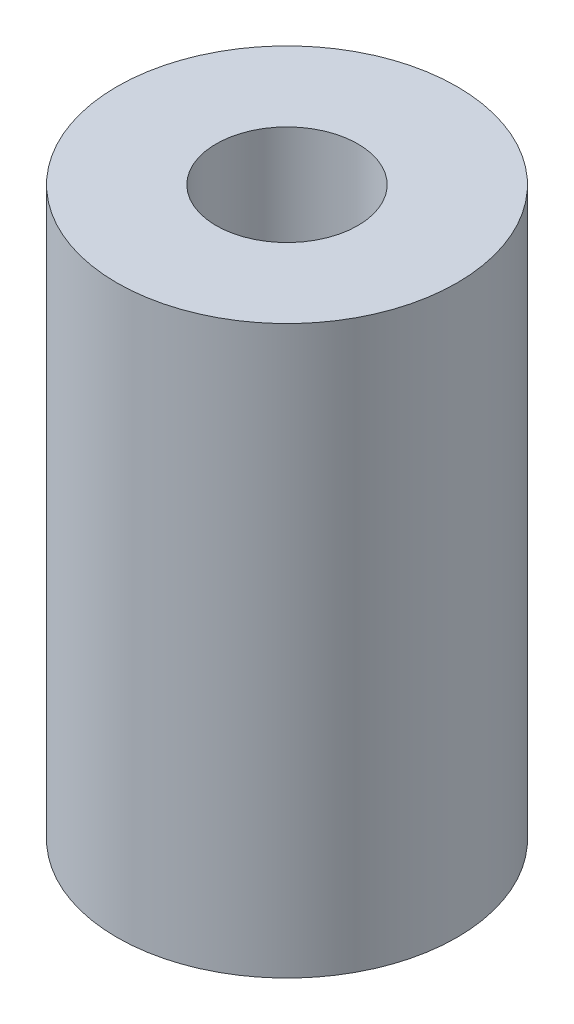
ISO-10303-21;
HEADER;
FILE_DESCRIPTION(('STEP AP214'),'2;1');
FILE_NAME('part.step','',(''),(''),'','','');
FILE_SCHEMA(('AUTOMOTIVE_DESIGN { 1 0 10303 214 1 1 1 1 }'));
ENDSEC;
DATA;
#1=APPLICATION_CONTEXT('core data for automotive mechanical design processes');
#2=APPLICATION_PROTOCOL_DEFINITION('international standard','automotive_design',2000,#1);
#3=PRODUCT_CONTEXT('',#1,'mechanical');
#4=PRODUCT('Part','Part','',(#3));
#5=PRODUCT_RELATED_PRODUCT_CATEGORY('part','',(#4));
#6=PRODUCT_DEFINITION_FORMATION('','',#4);
#7=PRODUCT_DEFINITION_CONTEXT('part definition',#1,'design');
#8=PRODUCT_DEFINITION('design','',#6,#7);
#9=PRODUCT_DEFINITION_SHAPE('','',#8);
#10=(LENGTH_UNIT() NAMED_UNIT(*) SI_UNIT(.MILLI.,.METRE.));
#11=(NAMED_UNIT(*) PLANE_ANGLE_UNIT() SI_UNIT($,.RADIAN.));
#12=(NAMED_UNIT(*) SI_UNIT($,.STERADIAN.) SOLID_ANGLE_UNIT());
#13=UNCERTAINTY_MEASURE_WITH_UNIT(LENGTH_MEASURE(1.E-05),#10,'distance_accuracy_value','');
#14=(GEOMETRIC_REPRESENTATION_CONTEXT(3) GLOBAL_UNCERTAINTY_ASSIGNED_CONTEXT((#13)) GLOBAL_UNIT_ASSIGNED_CONTEXT((#10,
#11,#12)) REPRESENTATION_CONTEXT('',''));
#15=CARTESIAN_POINT('',(0.,0.,0.));
#16=DIRECTION('',(0.,0.,1.));
#17=DIRECTION('',(1.,0.,0.));
#18=AXIS2_PLACEMENT_3D('',#15,#16,#17);
#19=CARTESIAN_POINT('',(7.62,19.05,0.));
#20=DIRECTION('',(0.,1.,0.));
#21=DIRECTION('',(-1.,0.,0.));
#22=AXIS2_PLACEMENT_3D('',#19,#20,#21);
#23=PLANE('',#22);
#24=CARTESIAN_POINT('',(0.,19.05,0.));
#25=DIRECTION('',(0.,-1.,0.));
#26=DIRECTION('',(1.,0.,0.));
#27=AXIS2_PLACEMENT_3D('',#24,#25,#26);
#28=CIRCLE('',#27,3.17500000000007);
#29=CARTESIAN_POINT('',(3.175,19.05,0.));
#30=VERTEX_POINT('',#29);
#31=EDGE_CURVE('E10',#30,#30,#28,.T.);
#32=ORIENTED_EDGE('',*,*,#31,.T.);
#33=EDGE_LOOP('',(#32));
#34=FACE_BOUND('',#33,.T.);
#35=CARTESIAN_POINT('',(0.,19.05,0.));
#36=DIRECTION('',(0.,-1.,0.));
#37=DIRECTION('',(1.,0.,0.));
#38=AXIS2_PLACEMENT_3D('',#35,#36,#37);
#39=CIRCLE('',#38,7.62000000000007);
#40=CARTESIAN_POINT('',(7.62,19.05,0.));
#41=VERTEX_POINT('',#40);
#42=EDGE_CURVE('E52',#41,#41,#39,.T.);
#43=ORIENTED_EDGE('',*,*,#42,.F.);
#44=EDGE_LOOP('',(#43));
#45=FACE_BOUND('',#44,.T.);
#46=ADVANCED_FACE('F30',(#34,#45),#23,.T.);
#47=CARTESIAN_POINT('',(5.64835935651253E-13,-161.77544166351,0.));
#48=DIRECTION('',(0.,-1.,0.));
#49=DIRECTION('',(1.,0.,0.));
#50=AXIS2_PLACEMENT_3D('',#47,#48,#49);
#51=CYLINDRICAL_SURFACE('',#50,3.17500000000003);
#52=CARTESIAN_POINT('',(0.,0.,0.));
#53=DIRECTION('',(0.,-1.,0.));
#54=DIRECTION('',(1.,0.,0.));
#55=AXIS2_PLACEMENT_3D('',#52,#53,#54);
#56=CIRCLE('',#55,3.175);
#57=CARTESIAN_POINT('',(3.175,0.,0.));
#58=VERTEX_POINT('',#57);
#59=EDGE_CURVE('E36',#58,#58,#56,.T.);
#60=ORIENTED_EDGE('',*,*,#59,.T.);
#61=EDGE_LOOP('',(#60));
#62=FACE_BOUND('',#61,.T.);
#63=ORIENTED_EDGE('',*,*,#31,.F.);
#64=EDGE_LOOP('',(#63));
#65=FACE_BOUND('',#64,.T.);
#66=ADVANCED_FACE('F60',(#62,#65),#51,.F.);
#67=CARTESIAN_POINT('',(3.175,0.,0.));
#68=DIRECTION('',(0.,-1.,0.));
#69=DIRECTION('',(1.,0.,0.));
#70=AXIS2_PLACEMENT_3D('',#67,#68,#69);
#71=PLANE('',#70);
#72=CARTESIAN_POINT('',(0.,0.,0.));
#73=DIRECTION('',(0.,-1.,0.));
#74=DIRECTION('',(1.,0.,0.));
#75=AXIS2_PLACEMENT_3D('',#72,#73,#74);
#76=CIRCLE('',#75,4.826);
#77=CARTESIAN_POINT('',(4.826,0.,0.));
#78=VERTEX_POINT('',#77);
#79=EDGE_CURVE('E40',#78,#78,#76,.T.);
#80=ORIENTED_EDGE('',*,*,#79,.T.);
#81=EDGE_LOOP('',(#80));
#82=FACE_BOUND('',#81,.T.);
#83=ORIENTED_EDGE('',*,*,#59,.F.);
#84=EDGE_LOOP('',(#83));
#85=FACE_BOUND('',#84,.T.);
#86=ADVANCED_FACE('F64',(#82,#85),#71,.T.);
#87=CARTESIAN_POINT('',(5.64835935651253E-13,-161.77544166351,0.));
#88=DIRECTION('',(0.,-1.,0.));
#89=DIRECTION('',(1.,0.,0.));
#90=AXIS2_PLACEMENT_3D('',#87,#88,#89);
#91=CYLINDRICAL_SURFACE('',#90,4.82599999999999);
#92=CARTESIAN_POINT('',(0.,-6.35000000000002,0.));
#93=DIRECTION('',(0.,-1.,0.));
#94=DIRECTION('',(1.,0.,0.));
#95=AXIS2_PLACEMENT_3D('',#92,#93,#94);
#96=CIRCLE('',#95,4.82599999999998);
#97=CARTESIAN_POINT('',(4.826,-6.35000000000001,0.));
#98=VERTEX_POINT('',#97);
#99=EDGE_CURVE('E44',#98,#98,#96,.T.);
#100=ORIENTED_EDGE('',*,*,#99,.T.);
#101=EDGE_LOOP('',(#100));
#102=FACE_BOUND('',#101,.T.);
#103=ORIENTED_EDGE('',*,*,#79,.F.);
#104=EDGE_LOOP('',(#103));
#105=FACE_BOUND('',#104,.T.);
#106=ADVANCED_FACE('F68',(#102,#105),#91,.F.);
#107=CARTESIAN_POINT('',(4.826,-6.35,0.));
#108=DIRECTION('',(0.,-1.,0.));
#109=DIRECTION('',(1.,0.,0.));
#110=AXIS2_PLACEMENT_3D('',#107,#108,#109);
#111=PLANE('',#110);
#112=CARTESIAN_POINT('',(0.,-6.35000000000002,0.));
#113=DIRECTION('',(0.,-1.,0.));
#114=DIRECTION('',(1.,0.,0.));
#115=AXIS2_PLACEMENT_3D('',#112,#113,#114);
#116=CIRCLE('',#115,7.61999999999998);
#117=CARTESIAN_POINT('',(7.62,-6.35,0.));
#118=VERTEX_POINT('',#117);
#119=EDGE_CURVE('E49',#118,#118,#116,.T.);
#120=ORIENTED_EDGE('',*,*,#119,.T.);
#121=EDGE_LOOP('',(#120));
#122=FACE_BOUND('',#121,.T.);
#123=ORIENTED_EDGE('',*,*,#99,.F.);
#124=EDGE_LOOP('',(#123));
#125=FACE_BOUND('',#124,.T.);
#126=ADVANCED_FACE('F75',(#122,#125),#111,.T.);
#127=CARTESIAN_POINT('',(5.64835935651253E-13,-161.77544166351,0.));
#128=DIRECTION('',(0.,-1.,0.));
#129=DIRECTION('',(1.,0.,0.));
#130=AXIS2_PLACEMENT_3D('',#127,#128,#129);
#131=CYLINDRICAL_SURFACE('',#130,7.62000000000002);
#132=ORIENTED_EDGE('',*,*,#42,.T.);
#133=EDGE_LOOP('',(#132));
#134=FACE_BOUND('',#133,.T.);
#135=ORIENTED_EDGE('',*,*,#119,.F.);
#136=EDGE_LOOP('',(#135));
#137=FACE_BOUND('',#136,.T.);
#138=ADVANCED_FACE('F56',(#134,#137),#131,.T.);
#139=CLOSED_SHELL('',(#46,#66,#86,#106,#126,#138));
#140=MANIFOLD_SOLID_BREP('B2',#139);
#141=ADVANCED_BREP_SHAPE_REPRESENTATION('',(#18,#140),#14);
#142=SHAPE_DEFINITION_REPRESENTATION(#9,#141);
ENDSEC;
END-ISO-10303-21;
